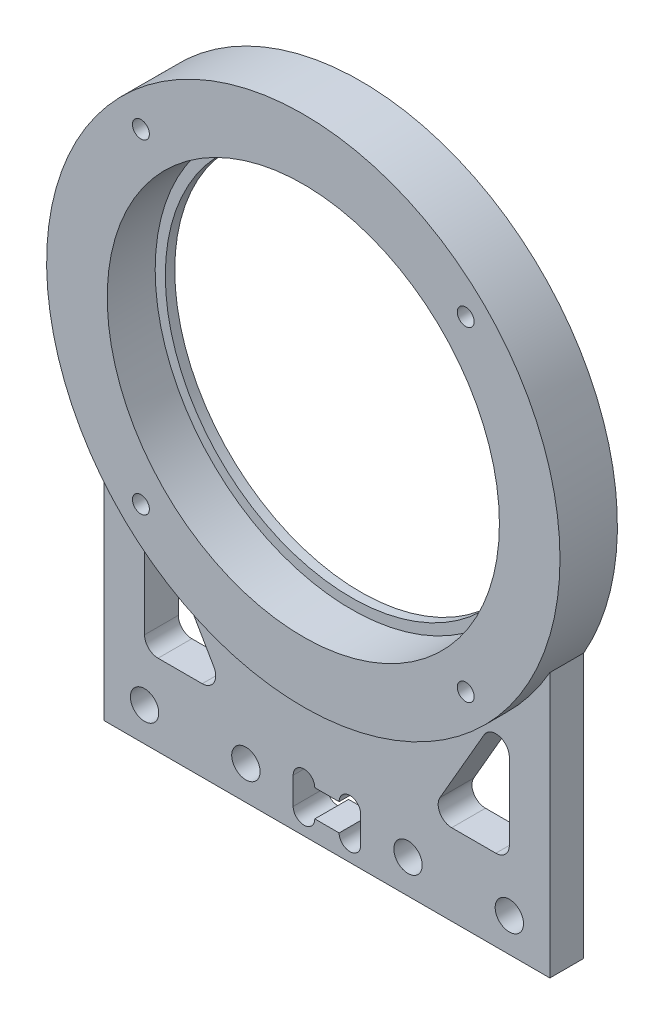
ISO-10303-21;
HEADER;
FILE_DESCRIPTION(('STEP AP214'),'2;1');
FILE_NAME('part.step','',(''),(''),'','','');
FILE_SCHEMA(('AUTOMOTIVE_DESIGN { 1 0 10303 214 1 1 1 1 }'));
ENDSEC;
DATA;
#1=APPLICATION_CONTEXT('core data for automotive mechanical design processes');
#2=APPLICATION_PROTOCOL_DEFINITION('international standard','automotive_design',2000,#1);
#3=PRODUCT_CONTEXT('',#1,'mechanical');
#4=PRODUCT('Part','Part','',(#3));
#5=PRODUCT_RELATED_PRODUCT_CATEGORY('part','',(#4));
#6=PRODUCT_DEFINITION_FORMATION('','',#4);
#7=PRODUCT_DEFINITION_CONTEXT('part definition',#1,'design');
#8=PRODUCT_DEFINITION('design','',#6,#7);
#9=PRODUCT_DEFINITION_SHAPE('','',#8);
#10=(LENGTH_UNIT() NAMED_UNIT(*) SI_UNIT(.MILLI.,.METRE.));
#11=(NAMED_UNIT(*) PLANE_ANGLE_UNIT() SI_UNIT($,.RADIAN.));
#12=(NAMED_UNIT(*) SI_UNIT($,.STERADIAN.) SOLID_ANGLE_UNIT());
#13=UNCERTAINTY_MEASURE_WITH_UNIT(LENGTH_MEASURE(1.E-05),#10,'distance_accuracy_value','');
#14=(GEOMETRIC_REPRESENTATION_CONTEXT(3) GLOBAL_UNCERTAINTY_ASSIGNED_CONTEXT((#13)) GLOBAL_UNIT_ASSIGNED_CONTEXT((#10,
#11,#12)) REPRESENTATION_CONTEXT('',''));
#15=CARTESIAN_POINT('',(0.,0.,0.));
#16=DIRECTION('',(0.,0.,1.));
#17=DIRECTION('',(1.,0.,0.));
#18=AXIS2_PLACEMENT_3D('',#15,#16,#17);
#19=CARTESIAN_POINT('',(0.,0.,1.4));
#20=DIRECTION('',(0.,0.,-1.));
#21=DIRECTION('',(0.,-1.,0.));
#22=AXIS2_PLACEMENT_3D('',#19,#20,#21);
#23=PLANE('',#22);
#24=CARTESIAN_POINT('',(0.,0.,1.4));
#25=DIRECTION('',(0.,0.,-1.));
#26=DIRECTION('',(-1.,0.,0.));
#27=AXIS2_PLACEMENT_3D('',#24,#25,#26);
#28=CIRCLE('',#27,27.53);
#29=CARTESIAN_POINT('',(-27.53,0.,1.4));
#30=VERTEX_POINT('',#29);
#31=EDGE_CURVE('E570',#30,#30,#28,.T.);
#32=ORIENTED_EDGE('',*,*,#31,.T.);
#33=EDGE_LOOP('',(#32));
#34=FACE_BOUND('',#33,.T.);
#35=CARTESIAN_POINT('',(0.,0.,1.4));
#36=DIRECTION('',(0.,0.,1.));
#37=DIRECTION('',(-1.,0.,0.));
#38=AXIS2_PLACEMENT_3D('',#35,#36,#37);
#39=CIRCLE('',#38,29.03);
#40=CARTESIAN_POINT('',(-29.03,0.,1.4));
#41=VERTEX_POINT('',#40);
#42=EDGE_CURVE('E160',#41,#41,#39,.T.);
#43=ORIENTED_EDGE('',*,*,#42,.T.);
#44=EDGE_LOOP('',(#43));
#45=FACE_BOUND('',#44,.T.);
#46=ADVANCED_FACE('F17',(#34,#45),#23,.F.);
#47=CARTESIAN_POINT('',(-25.,-44.,-21.5));
#48=DIRECTION('',(0.,0.,-1.));
#49=DIRECTION('',(-1.,0.,0.));
#50=AXIS2_PLACEMENT_3D('',#47,#48,#49);
#51=CYLINDRICAL_SURFACE('',#50,2.);
#52=CARTESIAN_POINT('',(-25.,-44.,0.));
#53=DIRECTION('',(0.,0.,1.));
#54=DIRECTION('',(1.,0.,0.));
#55=AXIS2_PLACEMENT_3D('',#52,#53,#54);
#56=CIRCLE('',#55,2.);
#57=CARTESIAN_POINT('',(-27.,-44.,0.));
#58=VERTEX_POINT('',#57);
#59=CARTESIAN_POINT('',(-25.,-46.,0.));
#60=VERTEX_POINT('',#59);
#61=EDGE_CURVE('E260',#58,#60,#56,.T.);
#62=ORIENTED_EDGE('',*,*,#61,.F.);
#63=DIRECTION('',(0.,0.,-1.));
#64=VECTOR('',#63,1.);
#65=CARTESIAN_POINT('',(-27.,-44.,0.));
#66=LINE('',#65,#64);
#67=CARTESIAN_POINT('',(-27.,-44.,5.));
#68=VERTEX_POINT('',#67);
#69=EDGE_CURVE('E11',#68,#58,#66,.T.);
#70=ORIENTED_EDGE('',*,*,#69,.F.);
#71=CARTESIAN_POINT('',(-25.,-44.,5.));
#72=DIRECTION('',(0.,0.,-1.));
#73=DIRECTION('',(1.,0.,0.));
#74=AXIS2_PLACEMENT_3D('',#71,#72,#73);
#75=CIRCLE('',#74,2.);
#76=CARTESIAN_POINT('',(-25.,-46.,5.));
#77=VERTEX_POINT('',#76);
#78=EDGE_CURVE('E323',#77,#68,#75,.T.);
#79=ORIENTED_EDGE('',*,*,#78,.F.);
#80=DIRECTION('',(0.,0.,1.));
#81=VECTOR('',#80,1.);
#82=CARTESIAN_POINT('',(-25.,-46.,5.));
#83=LINE('',#82,#81);
#84=EDGE_CURVE('E381',#60,#77,#83,.T.);
#85=ORIENTED_EDGE('',*,*,#84,.F.);
#86=EDGE_LOOP('',(#62,#70,#79,#85));
#87=FACE_BOUND('',#86,.T.);
#88=ADVANCED_FACE('F407',(#87),#51,.F.);
#89=CARTESIAN_POINT('',(-18.4641016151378,-44.,-21.5));
#90=DIRECTION('',(0.,0.,-1.));
#91=DIRECTION('',(-1.,0.,0.));
#92=AXIS2_PLACEMENT_3D('',#89,#90,#91);
#93=CYLINDRICAL_SURFACE('',#92,2.);
#94=CARTESIAN_POINT('',(-18.4641016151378,-44.,0.));
#95=DIRECTION('',(0.,0.,1.));
#96=DIRECTION('',(1.,0.,0.));
#97=AXIS2_PLACEMENT_3D('',#94,#95,#96);
#98=CIRCLE('',#97,2.);
#99=CARTESIAN_POINT('',(-18.4641016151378,-46.,0.));
#100=VERTEX_POINT('',#99);
#101=CARTESIAN_POINT('',(-16.7320508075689,-43.,0.));
#102=VERTEX_POINT('',#101);
#103=EDGE_CURVE('E272',#100,#102,#98,.T.);
#104=ORIENTED_EDGE('',*,*,#103,.F.);
#105=DIRECTION('',(0.,0.,-1.));
#106=VECTOR('',#105,1.);
#107=CARTESIAN_POINT('',(-18.4641016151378,-46.,0.));
#108=LINE('',#107,#106);
#109=CARTESIAN_POINT('',(-18.4641016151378,-46.,5.));
#110=VERTEX_POINT('',#109);
#111=EDGE_CURVE('E377',#110,#100,#108,.T.);
#112=ORIENTED_EDGE('',*,*,#111,.F.);
#113=CARTESIAN_POINT('',(-18.4641016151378,-44.,5.));
#114=DIRECTION('',(0.,0.,-1.));
#115=DIRECTION('',(1.,0.,0.));
#116=AXIS2_PLACEMENT_3D('',#113,#114,#115);
#117=CIRCLE('',#116,2.);
#118=CARTESIAN_POINT('',(-16.7320508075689,-43.,5.));
#119=VERTEX_POINT('',#118);
#120=EDGE_CURVE('E311',#119,#110,#117,.T.);
#121=ORIENTED_EDGE('',*,*,#120,.F.);
#122=DIRECTION('',(0.,0.,1.));
#123=VECTOR('',#122,1.);
#124=CARTESIAN_POINT('',(-16.7320508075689,-43.,5.));
#125=LINE('',#124,#123);
#126=EDGE_CURVE('E374',#102,#119,#125,.T.);
#127=ORIENTED_EDGE('',*,*,#126,.F.);
#128=EDGE_LOOP('',(#104,#112,#121,#127));
#129=FACE_BOUND('',#128,.T.);
#130=ADVANCED_FACE('F1425',(#129),#93,.F.);
#131=CARTESIAN_POINT('',(-25.,-32.6794919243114,-21.5));
#132=DIRECTION('',(0.,0.,-1.));
#133=DIRECTION('',(-1.,0.,0.));
#134=AXIS2_PLACEMENT_3D('',#131,#132,#133);
#135=CYLINDRICAL_SURFACE('',#134,2.);
#136=CARTESIAN_POINT('',(-25.,-32.6794919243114,0.));
#137=DIRECTION('',(0.,0.,1.));
#138=DIRECTION('',(1.,0.,0.));
#139=AXIS2_PLACEMENT_3D('',#136,#137,#138);
#140=CIRCLE('',#139,2.);
#141=CARTESIAN_POINT('',(-23.2679491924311,-31.6794919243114,0.));
#142=VERTEX_POINT('',#141);
#143=CARTESIAN_POINT('',(-27.,-32.6794919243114,0.));
#144=VERTEX_POINT('',#143);
#145=EDGE_CURVE('E280',#142,#144,#140,.T.);
#146=ORIENTED_EDGE('',*,*,#145,.F.);
#147=DIRECTION('',(0.,0.,-1.));
#148=VECTOR('',#147,1.);
#149=CARTESIAN_POINT('',(-23.2679491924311,-31.6794919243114,0.));
#150=LINE('',#149,#148);
#151=CARTESIAN_POINT('',(-23.2679491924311,-31.6794919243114,5.));
#152=VERTEX_POINT('',#151);
#153=EDGE_CURVE('E373',#152,#142,#150,.T.);
#154=ORIENTED_EDGE('',*,*,#153,.F.);
#155=CARTESIAN_POINT('',(-25.,-32.6794919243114,5.));
#156=DIRECTION('',(0.,0.,-1.));
#157=DIRECTION('',(1.,0.,0.));
#158=AXIS2_PLACEMENT_3D('',#155,#156,#157);
#159=CIRCLE('',#158,2.);
#160=CARTESIAN_POINT('',(-27.,-32.6794919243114,5.));
#161=VERTEX_POINT('',#160);
#162=EDGE_CURVE('E211',#161,#152,#159,.T.);
#163=ORIENTED_EDGE('',*,*,#162,.F.);
#164=DIRECTION('',(0.,0.,1.));
#165=VECTOR('',#164,1.);
#166=CARTESIAN_POINT('',(-27.,-32.6794919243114,8.5));
#167=LINE('',#166,#165);
#168=EDGE_CURVE('E26',#144,#161,#167,.T.);
#169=ORIENTED_EDGE('',*,*,#168,.F.);
#170=EDGE_LOOP('',(#146,#154,#163,#169));
#171=FACE_BOUND('',#170,.T.);
#172=ADVANCED_FACE('F397',(#171),#135,.F.);
#173=CARTESIAN_POINT('',(25.,-44.,-21.5));
#174=DIRECTION('',(0.,0.,-1.));
#175=DIRECTION('',(-1.,0.,0.));
#176=AXIS2_PLACEMENT_3D('',#173,#174,#175);
#177=CYLINDRICAL_SURFACE('',#176,2.);
#178=CARTESIAN_POINT('',(25.,-44.,0.));
#179=DIRECTION('',(0.,0.,1.));
#180=DIRECTION('',(1.,0.,0.));
#181=AXIS2_PLACEMENT_3D('',#178,#179,#180);
#182=CIRCLE('',#181,2.);
#183=CARTESIAN_POINT('',(25.,-46.,0.));
#184=VERTEX_POINT('',#183);
#185=CARTESIAN_POINT('',(27.,-44.,0.));
#186=VERTEX_POINT('',#185);
#187=EDGE_CURVE('E234',#184,#186,#182,.T.);
#188=ORIENTED_EDGE('',*,*,#187,.F.);
#189=DIRECTION('',(0.,0.,-1.));
#190=VECTOR('',#189,1.);
#191=CARTESIAN_POINT('',(25.,-46.,0.));
#192=LINE('',#191,#190);
#193=CARTESIAN_POINT('',(25.,-46.,5.));
#194=VERTEX_POINT('',#193);
#195=EDGE_CURVE('E359',#194,#184,#192,.T.);
#196=ORIENTED_EDGE('',*,*,#195,.F.);
#197=CARTESIAN_POINT('',(25.,-44.,5.));
#198=DIRECTION('',(0.,0.,-1.));
#199=DIRECTION('',(1.,0.,0.));
#200=AXIS2_PLACEMENT_3D('',#197,#198,#199);
#201=CIRCLE('',#200,2.);
#202=CARTESIAN_POINT('',(27.,-44.,5.));
#203=VERTEX_POINT('',#202);
#204=EDGE_CURVE('E149',#203,#194,#201,.T.);
#205=ORIENTED_EDGE('',*,*,#204,.F.);
#206=DIRECTION('',(0.,0.,1.));
#207=VECTOR('',#206,1.);
#208=CARTESIAN_POINT('',(27.,-44.,5.));
#209=LINE('',#208,#207);
#210=EDGE_CURVE('E370',#186,#203,#209,.T.);
#211=ORIENTED_EDGE('',*,*,#210,.F.);
#212=EDGE_LOOP('',(#188,#196,#205,#211));
#213=FACE_BOUND('',#212,.T.);
#214=ADVANCED_FACE('F1404',(#213),#177,.F.);
#215=CARTESIAN_POINT('',(25.,-32.6794919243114,-21.5));
#216=DIRECTION('',(0.,0.,-1.));
#217=DIRECTION('',(-1.,0.,0.));
#218=AXIS2_PLACEMENT_3D('',#215,#216,#217);
#219=CYLINDRICAL_SURFACE('',#218,2.);
#220=CARTESIAN_POINT('',(25.,-32.6794919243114,0.));
#221=DIRECTION('',(0.,0.,1.));
#222=DIRECTION('',(1.,0.,0.));
#223=AXIS2_PLACEMENT_3D('',#220,#221,#222);
#224=CIRCLE('',#223,2.);
#225=CARTESIAN_POINT('',(27.,-32.6794919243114,0.));
#226=VERTEX_POINT('',#225);
#227=CARTESIAN_POINT('',(23.2679491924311,-31.6794919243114,0.));
#228=VERTEX_POINT('',#227);
#229=EDGE_CURVE('E292',#226,#228,#224,.T.);
#230=ORIENTED_EDGE('',*,*,#229,.F.);
#231=DIRECTION('',(0.,0.,-1.));
#232=VECTOR('',#231,1.);
#233=CARTESIAN_POINT('',(27.,-32.6794919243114,0.));
#234=LINE('',#233,#232);
#235=CARTESIAN_POINT('',(27.,-32.6794919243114,5.));
#236=VERTEX_POINT('',#235);
#237=EDGE_CURVE('E366',#236,#226,#234,.T.);
#238=ORIENTED_EDGE('',*,*,#237,.F.);
#239=CARTESIAN_POINT('',(25.,-32.6794919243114,5.));
#240=DIRECTION('',(0.,0.,-1.));
#241=DIRECTION('',(1.,0.,0.));
#242=AXIS2_PLACEMENT_3D('',#239,#240,#241);
#243=CIRCLE('',#242,2.);
#244=CARTESIAN_POINT('',(23.2679491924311,-31.6794919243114,5.));
#245=VERTEX_POINT('',#244);
#246=EDGE_CURVE('E183',#245,#236,#243,.T.);
#247=ORIENTED_EDGE('',*,*,#246,.F.);
#248=DIRECTION('',(0.,0.,1.));
#249=VECTOR('',#248,1.);
#250=CARTESIAN_POINT('',(23.2679491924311,-31.6794919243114,8.5));
#251=LINE('',#250,#249);
#252=EDGE_CURVE('E363',#228,#245,#251,.T.);
#253=ORIENTED_EDGE('',*,*,#252,.F.);
#254=EDGE_LOOP('',(#230,#238,#247,#253));
#255=FACE_BOUND('',#254,.T.);
#256=ADVANCED_FACE('F1394',(#255),#219,.F.);
#257=CARTESIAN_POINT('',(-27.,-25.2153903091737,-21.5));
#258=DIRECTION('',(-1.,0.,0.));
#259=DIRECTION('',(0.,0.,1.));
#260=AXIS2_PLACEMENT_3D('',#257,#258,#259);
#261=PLANE('',#260);
#262=DIRECTION('',(0.,-1.,0.));
#263=VECTOR('',#262,1.);
#264=CARTESIAN_POINT('',(-27.,0.,0.));
#265=LINE('',#264,#263);
#266=EDGE_CURVE('E256',#144,#58,#265,.T.);
#267=ORIENTED_EDGE('',*,*,#266,.F.);
#268=ORIENTED_EDGE('',*,*,#168,.T.);
#269=DIRECTION('',(0.,-1.,0.));
#270=VECTOR('',#269,1.);
#271=CARTESIAN_POINT('',(-27.,0.,5.));
#272=LINE('',#271,#270);
#273=EDGE_CURVE('E216',#161,#68,#272,.T.);
#274=ORIENTED_EDGE('',*,*,#273,.T.);
#275=ORIENTED_EDGE('',*,*,#69,.T.);
#276=EDGE_LOOP('',(#267,#268,#274,#275));
#277=FACE_BOUND('',#276,.T.);
#278=ADVANCED_FACE('F391',(#277),#261,.F.);
#279=CARTESIAN_POINT('',(-27.,-46.,-21.5));
#280=DIRECTION('',(0.,-1.,0.));
#281=DIRECTION('',(0.,0.,-1.));
#282=AXIS2_PLACEMENT_3D('',#279,#280,#281);
#283=PLANE('',#282);
#284=DIRECTION('',(1.,0.,0.));
#285=VECTOR('',#284,1.);
#286=CARTESIAN_POINT('',(0.,-46.,5.));
#287=LINE('',#286,#285);
#288=EDGE_CURVE('E319',#77,#110,#287,.T.);
#289=ORIENTED_EDGE('',*,*,#288,.T.);
#290=ORIENTED_EDGE('',*,*,#111,.T.);
#291=DIRECTION('',(1.,0.,0.));
#292=VECTOR('',#291,1.);
#293=CARTESIAN_POINT('',(0.,-46.,0.));
#294=LINE('',#293,#292);
#295=EDGE_CURVE('E268',#60,#100,#294,.T.);
#296=ORIENTED_EDGE('',*,*,#295,.F.);
#297=ORIENTED_EDGE('',*,*,#84,.T.);
#298=EDGE_LOOP('',(#289,#290,#296,#297));
#299=FACE_BOUND('',#298,.T.);
#300=ADVANCED_FACE('F1374',(#299),#283,.F.);
#301=CARTESIAN_POINT('',(-15.,-46.,-21.5));
#302=DIRECTION('',(0.866025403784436,0.5,0.));
#303=DIRECTION('',(0.,0.,-1.));
#304=AXIS2_PLACEMENT_3D('',#301,#302,#303);
#305=PLANE('',#304);
#306=DIRECTION('',(-0.5,0.866025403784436,0.));
#307=VECTOR('',#306,1.);
#308=CARTESIAN_POINT('',(-31.1685842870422,-17.9951905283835,5.));
#309=LINE('',#308,#307);
#310=EDGE_CURVE('E215',#119,#152,#309,.T.);
#311=ORIENTED_EDGE('',*,*,#310,.T.);
#312=ORIENTED_EDGE('',*,*,#153,.T.);
#313=DIRECTION('',(-0.5,0.866025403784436,0.));
#314=VECTOR('',#313,1.);
#315=CARTESIAN_POINT('',(-31.1685842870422,-17.9951905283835,0.));
#316=LINE('',#315,#314);
#317=EDGE_CURVE('E276',#102,#142,#316,.T.);
#318=ORIENTED_EDGE('',*,*,#317,.F.);
#319=ORIENTED_EDGE('',*,*,#126,.T.);
#320=EDGE_LOOP('',(#311,#312,#318,#319));
#321=FACE_BOUND('',#320,.T.);
#322=ADVANCED_FACE('F1216',(#321),#305,.F.);
#323=CARTESIAN_POINT('',(27.,-25.2153903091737,-21.5));
#324=DIRECTION('',(1.,0.,0.));
#325=DIRECTION('',(0.,1.,0.));
#326=AXIS2_PLACEMENT_3D('',#323,#324,#325);
#327=PLANE('',#326);
#328=DIRECTION('',(0.,1.,0.));
#329=VECTOR('',#328,1.);
#330=CARTESIAN_POINT('',(27.,0.,5.));
#331=LINE('',#330,#329);
#332=EDGE_CURVE('E179',#203,#236,#331,.T.);
#333=ORIENTED_EDGE('',*,*,#332,.T.);
#334=ORIENTED_EDGE('',*,*,#237,.T.);
#335=DIRECTION('',(0.,1.,0.));
#336=VECTOR('',#335,1.);
#337=CARTESIAN_POINT('',(27.,0.,0.));
#338=LINE('',#337,#336);
#339=EDGE_CURVE('E288',#186,#226,#338,.T.);
#340=ORIENTED_EDGE('',*,*,#339,.F.);
#341=ORIENTED_EDGE('',*,*,#210,.T.);
#342=EDGE_LOOP('',(#333,#334,#340,#341));
#343=FACE_BOUND('',#342,.T.);
#344=ADVANCED_FACE('F1212',(#343),#327,.F.);
#345=CARTESIAN_POINT('',(15.,-46.,-21.5));
#346=DIRECTION('',(-0.866025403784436,0.5,0.));
#347=DIRECTION('',(0.,0.,1.));
#348=AXIS2_PLACEMENT_3D('',#345,#346,#347);
#349=PLANE('',#348);
#350=DIRECTION('',(-0.5,-0.866025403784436,0.));
#351=VECTOR('',#350,1.);
#352=CARTESIAN_POINT('',(31.1685842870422,-17.9951905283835,5.));
#353=LINE('',#352,#351);
#354=CARTESIAN_POINT('',(16.7320508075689,-43.,5.));
#355=VERTEX_POINT('',#354);
#356=EDGE_CURVE('E331',#245,#355,#353,.T.);
#357=ORIENTED_EDGE('',*,*,#356,.T.);
#358=DIRECTION('',(0.,0.,-1.));
#359=VECTOR('',#358,1.);
#360=CARTESIAN_POINT('',(16.7320508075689,-43.,0.));
#361=LINE('',#360,#359);
#362=CARTESIAN_POINT('',(16.7320508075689,-43.,0.));
#363=VERTEX_POINT('',#362);
#364=EDGE_CURVE('E153',#355,#363,#361,.T.);
#365=ORIENTED_EDGE('',*,*,#364,.T.);
#366=DIRECTION('',(-0.5,-0.866025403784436,0.));
#367=VECTOR('',#366,1.);
#368=CARTESIAN_POINT('',(31.1685842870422,-17.9951905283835,0.));
#369=LINE('',#368,#367);
#370=EDGE_CURVE('E611',#228,#363,#369,.T.);
#371=ORIENTED_EDGE('',*,*,#370,.F.);
#372=ORIENTED_EDGE('',*,*,#252,.T.);
#373=EDGE_LOOP('',(#357,#365,#371,#372));
#374=FACE_BOUND('',#373,.T.);
#375=ADVANCED_FACE('F610',(#374),#349,.F.);
#376=CARTESIAN_POINT('',(27.,-46.,-21.5));
#377=DIRECTION('',(0.,-1.,0.));
#378=DIRECTION('',(0.,0.,-1.));
#379=AXIS2_PLACEMENT_3D('',#376,#377,#378);
#380=PLANE('',#379);
#381=DIRECTION('',(1.,0.,0.));
#382=VECTOR('',#381,1.);
#383=CARTESIAN_POINT('',(0.,-46.,0.));
#384=LINE('',#383,#382);
#385=CARTESIAN_POINT('',(18.4641016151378,-46.,0.));
#386=VERTEX_POINT('',#385);
#387=EDGE_CURVE('E239',#386,#184,#384,.T.);
#388=ORIENTED_EDGE('',*,*,#387,.F.);
#389=DIRECTION('',(0.,0.,1.));
#390=VECTOR('',#389,1.);
#391=CARTESIAN_POINT('',(18.4641016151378,-46.,5.));
#392=LINE('',#391,#390);
#393=CARTESIAN_POINT('',(18.4641016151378,-46.,5.));
#394=VERTEX_POINT('',#393);
#395=EDGE_CURVE('E355',#386,#394,#392,.T.);
#396=ORIENTED_EDGE('',*,*,#395,.T.);
#397=DIRECTION('',(1.,0.,0.));
#398=VECTOR('',#397,1.);
#399=CARTESIAN_POINT('',(0.,-46.,5.));
#400=LINE('',#399,#398);
#401=EDGE_CURVE('E139',#394,#194,#400,.T.);
#402=ORIENTED_EDGE('',*,*,#401,.T.);
#403=ORIENTED_EDGE('',*,*,#195,.T.);
#404=EDGE_LOOP('',(#388,#396,#402,#403));
#405=FACE_BOUND('',#404,.T.);
#406=ADVANCED_FACE('F622',(#405),#380,.F.);
#407=CARTESIAN_POINT('',(3.4,-55.,-33.5));
#408=DIRECTION('',(0.,0.,1.));
#409=DIRECTION('',(1.,0.,0.));
#410=AXIS2_PLACEMENT_3D('',#407,#408,#409);
#411=CYLINDRICAL_SURFACE('',#410,1.6);
#412=CARTESIAN_POINT('',(3.4,-55.,0.));
#413=DIRECTION('',(0.,0.,1.));
#414=DIRECTION('',(1.,0.,0.));
#415=AXIS2_PLACEMENT_3D('',#412,#413,#414);
#416=CIRCLE('',#415,1.6);
#417=CARTESIAN_POINT('',(1.8,-55.,0.));
#418=VERTEX_POINT('',#417);
#419=CARTESIAN_POINT('',(5.,-55.,0.));
#420=VERTEX_POINT('',#419);
#421=EDGE_CURVE('E202',#418,#420,#416,.T.);
#422=ORIENTED_EDGE('',*,*,#421,.F.);
#423=DIRECTION('',(0.,0.,-1.));
#424=VECTOR('',#423,1.);
#425=CARTESIAN_POINT('',(1.8,-55.,-33.5));
#426=LINE('',#425,#424);
#427=CARTESIAN_POINT('',(1.8,-55.,5.));
#428=VERTEX_POINT('',#427);
#429=EDGE_CURVE('E40',#428,#418,#426,.T.);
#430=ORIENTED_EDGE('',*,*,#429,.F.);
#431=CARTESIAN_POINT('',(3.4,-55.,5.));
#432=DIRECTION('',(0.,0.,1.));
#433=DIRECTION('',(1.,0.,0.));
#434=AXIS2_PLACEMENT_3D('',#431,#432,#433);
#435=CIRCLE('',#434,1.6);
#436=CARTESIAN_POINT('',(5.,-55.,5.));
#437=VERTEX_POINT('',#436);
#438=EDGE_CURVE('E129',#428,#437,#435,.T.);
#439=ORIENTED_EDGE('',*,*,#438,.T.);
#440=DIRECTION('',(0.,0.,1.));
#441=VECTOR('',#440,1.);
#442=CARTESIAN_POINT('',(5.,-55.,-33.5));
#443=LINE('',#442,#441);
#444=EDGE_CURVE('E131',#420,#437,#443,.T.);
#445=ORIENTED_EDGE('',*,*,#444,.F.);
#446=EDGE_LOOP('',(#422,#430,#439,#445));
#447=FACE_BOUND('',#446,.T.);
#448=ADVANCED_FACE('F1281',(#447),#411,.F.);
#449=CARTESIAN_POINT('',(-3.4,-55.,-33.5));
#450=DIRECTION('',(0.,0.,1.));
#451=DIRECTION('',(1.,0.,0.));
#452=AXIS2_PLACEMENT_3D('',#449,#450,#451);
#453=CYLINDRICAL_SURFACE('',#452,1.6);
#454=CARTESIAN_POINT('',(-3.4,-55.,0.));
#455=DIRECTION('',(0.,0.,1.));
#456=DIRECTION('',(1.,0.,0.));
#457=AXIS2_PLACEMENT_3D('',#454,#455,#456);
#458=CIRCLE('',#457,1.6);
#459=CARTESIAN_POINT('',(-5.,-55.,0.));
#460=VERTEX_POINT('',#459);
#461=CARTESIAN_POINT('',(-1.8,-55.,0.));
#462=VERTEX_POINT('',#461);
#463=EDGE_CURVE('E296',#460,#462,#458,.T.);
#464=ORIENTED_EDGE('',*,*,#463,.F.);
#465=DIRECTION('',(0.,0.,1.));
#466=VECTOR('',#465,1.);
#467=CARTESIAN_POINT('',(-5.,-55.,-33.5));
#468=LINE('',#467,#466);
#469=CARTESIAN_POINT('',(-5.,-55.,5.));
#470=VERTEX_POINT('',#469);
#471=EDGE_CURVE('E135',#460,#470,#468,.T.);
#472=ORIENTED_EDGE('',*,*,#471,.T.);
#473=CARTESIAN_POINT('',(-3.4,-55.,5.));
#474=DIRECTION('',(0.,0.,1.));
#475=DIRECTION('',(1.,0.,0.));
#476=AXIS2_PLACEMENT_3D('',#473,#474,#475);
#477=CIRCLE('',#476,1.6);
#478=CARTESIAN_POINT('',(-1.8,-55.,5.));
#479=VERTEX_POINT('',#478);
#480=EDGE_CURVE('E127',#470,#479,#477,.T.);
#481=ORIENTED_EDGE('',*,*,#480,.T.);
#482=DIRECTION('',(0.,0.,1.));
#483=VECTOR('',#482,1.);
#484=CARTESIAN_POINT('',(-1.8,-55.,-33.5));
#485=LINE('',#484,#483);
#486=EDGE_CURVE('E107',#462,#479,#485,.T.);
#487=ORIENTED_EDGE('',*,*,#486,.F.);
#488=EDGE_LOOP('',(#464,#472,#481,#487));
#489=FACE_BOUND('',#488,.T.);
#490=ADVANCED_FACE('F133',(#489),#453,.F.);
#491=CARTESIAN_POINT('',(3.4,-51.,-33.5));
#492=DIRECTION('',(0.,0.,1.));
#493=DIRECTION('',(1.,0.,0.));
#494=AXIS2_PLACEMENT_3D('',#491,#492,#493);
#495=CYLINDRICAL_SURFACE('',#494,1.6);
#496=CARTESIAN_POINT('',(3.4,-51.,0.));
#497=DIRECTION('',(0.,0.,1.));
#498=DIRECTION('',(1.,0.,0.));
#499=AXIS2_PLACEMENT_3D('',#496,#497,#498);
#500=CIRCLE('',#499,1.6);
#501=CARTESIAN_POINT('',(5.,-51.,0.));
#502=VERTEX_POINT('',#501);
#503=CARTESIAN_POINT('',(1.8,-51.,0.));
#504=VERTEX_POINT('',#503);
#505=EDGE_CURVE('E243',#502,#504,#500,.T.);
#506=ORIENTED_EDGE('',*,*,#505,.F.);
#507=DIRECTION('',(0.,0.,1.));
#508=VECTOR('',#507,1.);
#509=CARTESIAN_POINT('',(5.,-51.,-33.5));
#510=LINE('',#509,#508);
#511=CARTESIAN_POINT('',(5.,-51.,5.));
#512=VERTEX_POINT('',#511);
#513=EDGE_CURVE('E120',#502,#512,#510,.T.);
#514=ORIENTED_EDGE('',*,*,#513,.T.);
#515=CARTESIAN_POINT('',(3.4,-51.,5.));
#516=DIRECTION('',(0.,0.,1.));
#517=DIRECTION('',(1.,0.,0.));
#518=AXIS2_PLACEMENT_3D('',#515,#516,#517);
#519=CIRCLE('',#518,1.6);
#520=CARTESIAN_POINT('',(1.8,-51.,5.));
#521=VERTEX_POINT('',#520);
#522=EDGE_CURVE('E343',#512,#521,#519,.T.);
#523=ORIENTED_EDGE('',*,*,#522,.T.);
#524=DIRECTION('',(0.,0.,1.));
#525=VECTOR('',#524,1.);
#526=CARTESIAN_POINT('',(1.8,-51.,-33.5));
#527=LINE('',#526,#525);
#528=EDGE_CURVE('E263',#504,#521,#527,.T.);
#529=ORIENTED_EDGE('',*,*,#528,.F.);
#530=EDGE_LOOP('',(#506,#514,#523,#529));
#531=FACE_BOUND('',#530,.T.);
#532=ADVANCED_FACE('F662',(#531),#495,.F.);
#533=CARTESIAN_POINT('',(-3.4,-51.,-33.5));
#534=DIRECTION('',(0.,0.,1.));
#535=DIRECTION('',(1.,0.,0.));
#536=AXIS2_PLACEMENT_3D('',#533,#534,#535);
#537=CYLINDRICAL_SURFACE('',#536,1.6);
#538=CARTESIAN_POINT('',(-3.4,-51.,0.));
#539=DIRECTION('',(0.,0.,1.));
#540=DIRECTION('',(1.,0.,0.));
#541=AXIS2_PLACEMENT_3D('',#538,#539,#540);
#542=CIRCLE('',#541,1.6);
#543=CARTESIAN_POINT('',(-1.8,-51.,0.));
#544=VERTEX_POINT('',#543);
#545=CARTESIAN_POINT('',(-5.,-51.,0.));
#546=VERTEX_POINT('',#545);
#547=EDGE_CURVE('E196',#544,#546,#542,.T.);
#548=ORIENTED_EDGE('',*,*,#547,.F.);
#549=DIRECTION('',(0.,0.,-1.));
#550=VECTOR('',#549,1.);
#551=CARTESIAN_POINT('',(-1.8,-51.,-33.5));
#552=LINE('',#551,#550);
#553=CARTESIAN_POINT('',(-1.8,-51.,5.));
#554=VERTEX_POINT('',#553);
#555=EDGE_CURVE('E315',#554,#544,#552,.T.);
#556=ORIENTED_EDGE('',*,*,#555,.F.);
#557=CARTESIAN_POINT('',(-3.4,-51.,5.));
#558=DIRECTION('',(0.,0.,1.));
#559=DIRECTION('',(1.,0.,0.));
#560=AXIS2_PLACEMENT_3D('',#557,#558,#559);
#561=CIRCLE('',#560,1.6);
#562=CARTESIAN_POINT('',(-5.,-51.,5.));
#563=VERTEX_POINT('',#562);
#564=EDGE_CURVE('E146',#554,#563,#561,.T.);
#565=ORIENTED_EDGE('',*,*,#564,.T.);
#566=DIRECTION('',(0.,0.,1.));
#567=VECTOR('',#566,1.);
#568=CARTESIAN_POINT('',(-5.,-51.,-33.5));
#569=LINE('',#568,#567);
#570=EDGE_CURVE('E264',#546,#563,#569,.T.);
#571=ORIENTED_EDGE('',*,*,#570,.F.);
#572=EDGE_LOOP('',(#548,#556,#565,#571));
#573=FACE_BOUND('',#572,.T.);
#574=ADVANCED_FACE('F656',(#573),#537,.F.);
#575=CARTESIAN_POINT('',(-5.,-51.,-33.5));
#576=DIRECTION('',(0.,1.,0.));
#577=DIRECTION('',(1.,0.,0.));
#578=AXIS2_PLACEMENT_3D('',#575,#576,#577);
#579=PLANE('',#578);
#580=DIRECTION('',(-1.,0.,0.));
#581=VECTOR('',#580,1.);
#582=CARTESIAN_POINT('',(0.,-51.,0.));
#583=LINE('',#582,#581);
#584=EDGE_CURVE('E201',#504,#544,#583,.T.);
#585=ORIENTED_EDGE('',*,*,#584,.F.);
#586=ORIENTED_EDGE('',*,*,#528,.T.);
#587=DIRECTION('',(-1.,0.,0.));
#588=VECTOR('',#587,1.);
#589=CARTESIAN_POINT('',(0.,-51.,5.));
#590=LINE('',#589,#588);
#591=EDGE_CURVE('E327',#521,#554,#590,.T.);
#592=ORIENTED_EDGE('',*,*,#591,.T.);
#593=ORIENTED_EDGE('',*,*,#555,.T.);
#594=EDGE_LOOP('',(#585,#586,#592,#593));
#595=FACE_BOUND('',#594,.T.);
#596=ADVANCED_FACE('F659',(#595),#579,.F.);
#597=CARTESIAN_POINT('',(-5.,-51.,-33.5));
#598=DIRECTION('',(-1.,0.,0.));
#599=DIRECTION('',(0.,0.,1.));
#600=AXIS2_PLACEMENT_3D('',#597,#598,#599);
#601=PLANE('',#600);
#602=ORIENTED_EDGE('',*,*,#570,.T.);
#603=DIRECTION('',(0.,-1.,0.));
#604=VECTOR('',#603,1.);
#605=CARTESIAN_POINT('',(-5.,0.,5.));
#606=LINE('',#605,#604);
#607=EDGE_CURVE('E138',#563,#470,#606,.T.);
#608=ORIENTED_EDGE('',*,*,#607,.T.);
#609=ORIENTED_EDGE('',*,*,#471,.F.);
#610=DIRECTION('',(0.,-1.,0.));
#611=VECTOR('',#610,1.);
#612=CARTESIAN_POINT('',(-5.,0.,0.));
#613=LINE('',#612,#611);
#614=EDGE_CURVE('E238',#546,#460,#613,.T.);
#615=ORIENTED_EDGE('',*,*,#614,.F.);
#616=EDGE_LOOP('',(#602,#608,#609,#615));
#617=FACE_BOUND('',#616,.T.);
#618=ADVANCED_FACE('F651',(#617),#601,.F.);
#619=CARTESIAN_POINT('',(-5.,-55.,-33.5));
#620=DIRECTION('',(0.,-1.,0.));
#621=DIRECTION('',(0.,0.,-1.));
#622=AXIS2_PLACEMENT_3D('',#619,#620,#621);
#623=PLANE('',#622);
#624=DIRECTION('',(1.,0.,0.));
#625=VECTOR('',#624,1.);
#626=CARTESIAN_POINT('',(0.,-55.,0.));
#627=LINE('',#626,#625);
#628=EDGE_CURVE('E114',#462,#418,#627,.T.);
#629=ORIENTED_EDGE('',*,*,#628,.F.);
#630=ORIENTED_EDGE('',*,*,#486,.T.);
#631=DIRECTION('',(1.,0.,0.));
#632=VECTOR('',#631,1.);
#633=CARTESIAN_POINT('',(0.,-55.,5.));
#634=LINE('',#633,#632);
#635=EDGE_CURVE('E110',#479,#428,#634,.T.);
#636=ORIENTED_EDGE('',*,*,#635,.T.);
#637=ORIENTED_EDGE('',*,*,#429,.T.);
#638=EDGE_LOOP('',(#629,#630,#636,#637));
#639=FACE_BOUND('',#638,.T.);
#640=ADVANCED_FACE('F109',(#639),#623,.F.);
#641=CARTESIAN_POINT('',(5.,-51.,-33.5));
#642=DIRECTION('',(1.,0.,0.));
#643=DIRECTION('',(0.,1.,0.));
#644=AXIS2_PLACEMENT_3D('',#641,#642,#643);
#645=PLANE('',#644);
#646=ORIENTED_EDGE('',*,*,#444,.T.);
#647=DIRECTION('',(0.,1.,0.));
#648=VECTOR('',#647,1.);
#649=CARTESIAN_POINT('',(5.,0.,5.));
#650=LINE('',#649,#648);
#651=EDGE_CURVE('E347',#437,#512,#650,.T.);
#652=ORIENTED_EDGE('',*,*,#651,.T.);
#653=ORIENTED_EDGE('',*,*,#513,.F.);
#654=DIRECTION('',(0.,1.,0.));
#655=VECTOR('',#654,1.);
#656=CARTESIAN_POINT('',(5.,0.,0.));
#657=LINE('',#656,#655);
#658=EDGE_CURVE('E206',#420,#502,#657,.T.);
#659=ORIENTED_EDGE('',*,*,#658,.F.);
#660=EDGE_LOOP('',(#646,#652,#653,#659));
#661=FACE_BOUND('',#660,.T.);
#662=ADVANCED_FACE('F1273',(#661),#645,.F.);
#663=CARTESIAN_POINT('',(0.,0.,5.));
#664=DIRECTION('',(0.,0.,1.));
#665=DIRECTION('',(1.,0.,0.));
#666=AXIS2_PLACEMENT_3D('',#663,#664,#665);
#667=PLANE('',#666);
#668=CARTESIAN_POINT('',(27.,-53.,5.));
#669=DIRECTION('',(0.,0.,1.));
#670=DIRECTION('',(1.,0.,0.));
#671=AXIS2_PLACEMENT_3D('',#668,#669,#670);
#672=CIRCLE('',#671,2.1);
#673=CARTESIAN_POINT('',(29.1,-53.,5.));
#674=VERTEX_POINT('',#673);
#675=EDGE_CURVE('E188',#674,#674,#672,.T.);
#676=ORIENTED_EDGE('',*,*,#675,.F.);
#677=EDGE_LOOP('',(#676));
#678=FACE_BOUND('',#677,.T.);
#679=CARTESIAN_POINT('',(12.,-53.,5.));
#680=DIRECTION('',(0.,0.,1.));
#681=DIRECTION('',(1.,0.,0.));
#682=AXIS2_PLACEMENT_3D('',#679,#680,#681);
#683=CIRCLE('',#682,2.1);
#684=CARTESIAN_POINT('',(14.1,-53.,5.));
#685=VERTEX_POINT('',#684);
#686=EDGE_CURVE('E178',#685,#685,#683,.T.);
#687=ORIENTED_EDGE('',*,*,#686,.F.);
#688=EDGE_LOOP('',(#687));
#689=FACE_BOUND('',#688,.T.);
#690=CARTESIAN_POINT('',(-12.,-53.,5.));
#691=DIRECTION('',(0.,0.,1.));
#692=DIRECTION('',(1.,0.,0.));
#693=AXIS2_PLACEMENT_3D('',#690,#691,#692);
#694=CIRCLE('',#693,2.1);
#695=CARTESIAN_POINT('',(-9.9,-53.,5.));
#696=VERTEX_POINT('',#695);
#697=EDGE_CURVE('E170',#696,#696,#694,.T.);
#698=ORIENTED_EDGE('',*,*,#697,.F.);
#699=EDGE_LOOP('',(#698));
#700=FACE_BOUND('',#699,.T.);
#701=CARTESIAN_POINT('',(-27.,-53.,5.));
#702=DIRECTION('',(0.,0.,1.));
#703=DIRECTION('',(1.,0.,0.));
#704=AXIS2_PLACEMENT_3D('',#701,#702,#703);
#705=CIRCLE('',#704,2.1);
#706=CARTESIAN_POINT('',(-24.9,-53.,5.));
#707=VERTEX_POINT('',#706);
#708=EDGE_CURVE('E159',#707,#707,#705,.T.);
#709=ORIENTED_EDGE('',*,*,#708,.F.);
#710=EDGE_LOOP('',(#709));
#711=FACE_BOUND('',#710,.T.);
#712=ORIENTED_EDGE('',*,*,#480,.F.);
#713=ORIENTED_EDGE('',*,*,#607,.F.);
#714=ORIENTED_EDGE('',*,*,#564,.F.);
#715=ORIENTED_EDGE('',*,*,#591,.F.);
#716=ORIENTED_EDGE('',*,*,#522,.F.);
#717=ORIENTED_EDGE('',*,*,#651,.F.);
#718=ORIENTED_EDGE('',*,*,#438,.F.);
#719=ORIENTED_EDGE('',*,*,#635,.F.);
#720=EDGE_LOOP('',(#712,#713,#714,#715,#716,#717,#718,#719));
#721=FACE_BOUND('',#720,.T.);
#722=ORIENTED_EDGE('',*,*,#356,.F.);
#723=ORIENTED_EDGE('',*,*,#246,.T.);
#724=ORIENTED_EDGE('',*,*,#332,.F.);
#725=ORIENTED_EDGE('',*,*,#204,.T.);
#726=ORIENTED_EDGE('',*,*,#401,.F.);
#727=CARTESIAN_POINT('',(18.4641016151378,-44.,5.));
#728=DIRECTION('',(0.,0.,-1.));
#729=DIRECTION('',(1.,0.,0.));
#730=AXIS2_PLACEMENT_3D('',#727,#728,#729);
#731=CIRCLE('',#730,2.);
#732=EDGE_CURVE('E583',#394,#355,#731,.T.);
#733=ORIENTED_EDGE('',*,*,#732,.T.);
#734=EDGE_LOOP('',(#722,#723,#724,#725,#726,#733));
#735=FACE_BOUND('',#734,.T.);
#736=ORIENTED_EDGE('',*,*,#273,.F.);
#737=ORIENTED_EDGE('',*,*,#162,.T.);
#738=ORIENTED_EDGE('',*,*,#310,.F.);
#739=ORIENTED_EDGE('',*,*,#120,.T.);
#740=ORIENTED_EDGE('',*,*,#288,.F.);
#741=ORIENTED_EDGE('',*,*,#78,.T.);
#742=EDGE_LOOP('',(#736,#737,#738,#739,#740,#741));
#743=FACE_BOUND('',#742,.T.);
#744=CARTESIAN_POINT('',(0.,0.,5.));
#745=DIRECTION('',(0.,0.,-1.));
#746=DIRECTION('',(1.,0.,0.));
#747=AXIS2_PLACEMENT_3D('',#744,#745,#746);
#748=CIRCLE('',#747,38.);
#749=CARTESIAN_POINT('',(33.,-18.8414436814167,5.));
#750=VERTEX_POINT('',#749);
#751=CARTESIAN_POINT('',(-33.,-18.8414436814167,5.));
#752=VERTEX_POINT('',#751);
#753=EDGE_CURVE('E229',#750,#752,#748,.T.);
#754=ORIENTED_EDGE('',*,*,#753,.T.);
#755=DIRECTION('',(0.,-1.,0.));
#756=VECTOR('',#755,1.);
#757=CARTESIAN_POINT('',(-33.,-58.,5.));
#758=LINE('',#757,#756);
#759=CARTESIAN_POINT('',(-33.,-58.,5.));
#760=VERTEX_POINT('',#759);
#761=EDGE_CURVE('E284',#752,#760,#758,.T.);
#762=ORIENTED_EDGE('',*,*,#761,.T.);
#763=DIRECTION('',(1.,0.,0.));
#764=VECTOR('',#763,1.);
#765=CARTESIAN_POINT('',(-33.,-58.,5.));
#766=LINE('',#765,#764);
#767=CARTESIAN_POINT('',(33.,-58.,5.));
#768=VERTEX_POINT('',#767);
#769=EDGE_CURVE('E225',#760,#768,#766,.T.);
#770=ORIENTED_EDGE('',*,*,#769,.T.);
#771=DIRECTION('',(0.,1.,0.));
#772=VECTOR('',#771,1.);
#773=CARTESIAN_POINT('',(33.,-58.,5.));
#774=LINE('',#773,#772);
#775=EDGE_CURVE('E200',#768,#750,#774,.T.);
#776=ORIENTED_EDGE('',*,*,#775,.T.);
#777=EDGE_LOOP('',(#754,#762,#770,#776));
#778=FACE_BOUND('',#777,.T.);
#779=ADVANCED_FACE('F124',(#678,#689,#700,#711,#721,#735,#743,#778),#667,.T.);
#780=CARTESIAN_POINT('',(-33.,-58.,5.));
#781=DIRECTION('',(0.,1.,0.));
#782=DIRECTION('',(1.,0.,0.));
#783=AXIS2_PLACEMENT_3D('',#780,#781,#782);
#784=PLANE('',#783);
#785=DIRECTION('',(1.,0.,0.));
#786=VECTOR('',#785,1.);
#787=CARTESIAN_POINT('',(-33.,-58.,0.));
#788=LINE('',#787,#786);
#789=CARTESIAN_POINT('',(-33.,-58.,0.));
#790=VERTEX_POINT('',#789);
#791=CARTESIAN_POINT('',(33.,-58.,0.));
#792=VERTEX_POINT('',#791);
#793=EDGE_CURVE('E248',#790,#792,#788,.T.);
#794=ORIENTED_EDGE('',*,*,#793,.T.);
#795=DIRECTION('',(0.,0.,-1.));
#796=VECTOR('',#795,1.);
#797=CARTESIAN_POINT('',(33.,-58.,5.));
#798=LINE('',#797,#796);
#799=EDGE_CURVE('E217',#768,#792,#798,.T.);
#800=ORIENTED_EDGE('',*,*,#799,.F.);
#801=ORIENTED_EDGE('',*,*,#769,.F.);
#802=DIRECTION('',(0.,0.,-1.));
#803=VECTOR('',#802,1.);
#804=CARTESIAN_POINT('',(-33.,-58.,5.));
#805=LINE('',#804,#803);
#806=EDGE_CURVE('E221',#760,#790,#805,.T.);
#807=ORIENTED_EDGE('',*,*,#806,.T.);
#808=EDGE_LOOP('',(#794,#800,#801,#807));
#809=FACE_BOUND('',#808,.T.);
#810=ADVANCED_FACE('F516',(#809),#784,.F.);
#811=CARTESIAN_POINT('',(-33.,-58.,5.));
#812=DIRECTION('',(1.,0.,0.));
#813=DIRECTION('',(0.,1.,0.));
#814=AXIS2_PLACEMENT_3D('',#811,#812,#813);
#815=PLANE('',#814);
#816=DIRECTION('',(0.,-1.,0.));
#817=VECTOR('',#816,1.);
#818=CARTESIAN_POINT('',(-33.,-58.,0.));
#819=LINE('',#818,#817);
#820=CARTESIAN_POINT('',(-33.,-18.8414436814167,0.));
#821=VERTEX_POINT('',#820);
#822=EDGE_CURVE('E252',#821,#790,#819,.T.);
#823=ORIENTED_EDGE('',*,*,#822,.T.);
#824=ORIENTED_EDGE('',*,*,#806,.F.);
#825=ORIENTED_EDGE('',*,*,#761,.F.);
#826=DIRECTION('',(0.,0.,-1.));
#827=VECTOR('',#826,1.);
#828=CARTESIAN_POINT('',(-33.,-18.8414436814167,5.));
#829=LINE('',#828,#827);
#830=EDGE_CURVE('E209',#752,#821,#829,.T.);
#831=ORIENTED_EDGE('',*,*,#830,.T.);
#832=EDGE_LOOP('',(#823,#824,#825,#831));
#833=FACE_BOUND('',#832,.T.);
#834=ADVANCED_FACE('F523',(#833),#815,.F.);
#835=CARTESIAN_POINT('',(33.,-58.,5.));
#836=DIRECTION('',(-1.,0.,0.));
#837=DIRECTION('',(0.,0.,1.));
#838=AXIS2_PLACEMENT_3D('',#835,#836,#837);
#839=PLANE('',#838);
#840=DIRECTION('',(0.,1.,0.));
#841=VECTOR('',#840,1.);
#842=CARTESIAN_POINT('',(33.,-58.,0.));
#843=LINE('',#842,#841);
#844=CARTESIAN_POINT('',(33.,-18.8414436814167,0.));
#845=VERTEX_POINT('',#844);
#846=EDGE_CURVE('E244',#792,#845,#843,.T.);
#847=ORIENTED_EDGE('',*,*,#846,.T.);
#848=DIRECTION('',(0.,0.,-1.));
#849=VECTOR('',#848,1.);
#850=CARTESIAN_POINT('',(33.,-18.8414436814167,5.));
#851=LINE('',#850,#849);
#852=EDGE_CURVE('E233',#750,#845,#851,.T.);
#853=ORIENTED_EDGE('',*,*,#852,.F.);
#854=ORIENTED_EDGE('',*,*,#775,.F.);
#855=ORIENTED_EDGE('',*,*,#799,.T.);
#856=EDGE_LOOP('',(#847,#853,#854,#855));
#857=FACE_BOUND('',#856,.T.);
#858=ADVANCED_FACE('F529',(#857),#839,.F.);
#859=CARTESIAN_POINT('',(0.,0.,0.));
#860=DIRECTION('',(0.,0.,1.));
#861=DIRECTION('',(1.,0.,0.));
#862=AXIS2_PLACEMENT_3D('',#859,#860,#861);
#863=PLANE('',#862);
#864=CARTESIAN_POINT('',(0.,0.,0.));
#865=DIRECTION('',(0.,0.,-1.));
#866=DIRECTION('',(-1.,0.,0.));
#867=AXIS2_PLACEMENT_3D('',#864,#865,#866);
#868=CIRCLE('',#867,27.53);
#869=CARTESIAN_POINT('',(-27.53,0.,0.));
#870=VERTEX_POINT('',#869);
#871=EDGE_CURVE('E576',#870,#870,#868,.T.);
#872=ORIENTED_EDGE('',*,*,#871,.F.);
#873=EDGE_LOOP('',(#872));
#874=FACE_BOUND('',#873,.T.);
#875=CARTESIAN_POINT('',(27.,-53.,0.));
#876=DIRECTION('',(0.,0.,1.));
#877=DIRECTION('',(1.,0.,0.));
#878=AXIS2_PLACEMENT_3D('',#875,#876,#877);
#879=CIRCLE('',#878,2.1);
#880=CARTESIAN_POINT('',(29.1,-53.,0.));
#881=VERTEX_POINT('',#880);
#882=EDGE_CURVE('E184',#881,#881,#879,.T.);
#883=ORIENTED_EDGE('',*,*,#882,.T.);
#884=EDGE_LOOP('',(#883));
#885=FACE_BOUND('',#884,.T.);
#886=CARTESIAN_POINT('',(12.,-53.,0.));
#887=DIRECTION('',(0.,0.,1.));
#888=DIRECTION('',(1.,0.,0.));
#889=AXIS2_PLACEMENT_3D('',#886,#887,#888);
#890=CIRCLE('',#889,2.1);
#891=CARTESIAN_POINT('',(14.1,-53.,0.));
#892=VERTEX_POINT('',#891);
#893=EDGE_CURVE('E174',#892,#892,#890,.T.);
#894=ORIENTED_EDGE('',*,*,#893,.T.);
#895=EDGE_LOOP('',(#894));
#896=FACE_BOUND('',#895,.T.);
#897=CARTESIAN_POINT('',(-12.,-53.,0.));
#898=DIRECTION('',(0.,0.,1.));
#899=DIRECTION('',(1.,0.,0.));
#900=AXIS2_PLACEMENT_3D('',#897,#898,#899);
#901=CIRCLE('',#900,2.1);
#902=CARTESIAN_POINT('',(-9.9,-53.,0.));
#903=VERTEX_POINT('',#902);
#904=EDGE_CURVE('E166',#903,#903,#901,.T.);
#905=ORIENTED_EDGE('',*,*,#904,.T.);
#906=EDGE_LOOP('',(#905));
#907=FACE_BOUND('',#906,.T.);
#908=CARTESIAN_POINT('',(-27.,-53.,0.));
#909=DIRECTION('',(0.,0.,1.));
#910=DIRECTION('',(1.,0.,0.));
#911=AXIS2_PLACEMENT_3D('',#908,#909,#910);
#912=CIRCLE('',#911,2.1);
#913=CARTESIAN_POINT('',(-24.9,-53.,0.));
#914=VERTEX_POINT('',#913);
#915=EDGE_CURVE('E155',#914,#914,#912,.T.);
#916=ORIENTED_EDGE('',*,*,#915,.T.);
#917=EDGE_LOOP('',(#916));
#918=FACE_BOUND('',#917,.T.);
#919=ORIENTED_EDGE('',*,*,#614,.T.);
#920=ORIENTED_EDGE('',*,*,#463,.T.);
#921=ORIENTED_EDGE('',*,*,#628,.T.);
#922=ORIENTED_EDGE('',*,*,#421,.T.);
#923=ORIENTED_EDGE('',*,*,#658,.T.);
#924=ORIENTED_EDGE('',*,*,#505,.T.);
#925=ORIENTED_EDGE('',*,*,#584,.T.);
#926=ORIENTED_EDGE('',*,*,#547,.T.);
#927=EDGE_LOOP('',(#919,#920,#921,#922,#923,#924,#925,#926));
#928=FACE_BOUND('',#927,.T.);
#929=ORIENTED_EDGE('',*,*,#339,.T.);
#930=ORIENTED_EDGE('',*,*,#229,.T.);
#931=ORIENTED_EDGE('',*,*,#370,.T.);
#932=CARTESIAN_POINT('',(18.4641016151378,-44.,0.));
#933=DIRECTION('',(0.,0.,1.));
#934=DIRECTION('',(1.,0.,0.));
#935=AXIS2_PLACEMENT_3D('',#932,#933,#934);
#936=CIRCLE('',#935,2.);
#937=EDGE_CURVE('E590',#363,#386,#936,.T.);
#938=ORIENTED_EDGE('',*,*,#937,.T.);
#939=ORIENTED_EDGE('',*,*,#387,.T.);
#940=ORIENTED_EDGE('',*,*,#187,.T.);
#941=EDGE_LOOP('',(#929,#930,#931,#938,#939,#940));
#942=FACE_BOUND('',#941,.T.);
#943=ORIENTED_EDGE('',*,*,#266,.T.);
#944=ORIENTED_EDGE('',*,*,#61,.T.);
#945=ORIENTED_EDGE('',*,*,#295,.T.);
#946=ORIENTED_EDGE('',*,*,#103,.T.);
#947=ORIENTED_EDGE('',*,*,#317,.T.);
#948=ORIENTED_EDGE('',*,*,#145,.T.);
#949=EDGE_LOOP('',(#943,#944,#945,#946,#947,#948));
#950=FACE_BOUND('',#949,.T.);
#951=CARTESIAN_POINT('',(-24.0416305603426,24.0416305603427,0.));
#952=DIRECTION('',(0.,0.,1.));
#953=DIRECTION('',(1.,0.,0.));
#954=AXIS2_PLACEMENT_3D('',#951,#952,#953);
#955=CIRCLE('',#954,1.25);
#956=CARTESIAN_POINT('',(-22.7916305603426,24.0416305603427,0.));
#957=VERTEX_POINT('',#956);
#958=EDGE_CURVE('E560',#957,#957,#955,.T.);
#959=ORIENTED_EDGE('',*,*,#958,.T.);
#960=EDGE_LOOP('',(#959));
#961=FACE_BOUND('',#960,.T.);
#962=CARTESIAN_POINT('',(24.0416305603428,24.0416305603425,0.));
#963=DIRECTION('',(0.,0.,1.));
#964=DIRECTION('',(1.,0.,0.));
#965=AXIS2_PLACEMENT_3D('',#962,#963,#964);
#966=CIRCLE('',#965,1.25);
#967=CARTESIAN_POINT('',(25.2916305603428,24.0416305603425,0.));
#968=VERTEX_POINT('',#967);
#969=EDGE_CURVE('E545',#968,#968,#966,.T.);
#970=ORIENTED_EDGE('',*,*,#969,.T.);
#971=EDGE_LOOP('',(#970));
#972=FACE_BOUND('',#971,.T.);
#973=CARTESIAN_POINT('',(24.0416305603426,-24.0416305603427,0.));
#974=DIRECTION('',(0.,0.,1.));
#975=DIRECTION('',(1.,0.,0.));
#976=AXIS2_PLACEMENT_3D('',#973,#974,#975);
#977=CIRCLE('',#976,1.25);
#978=CARTESIAN_POINT('',(25.2916305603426,-24.0416305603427,0.));
#979=VERTEX_POINT('',#978);
#980=EDGE_CURVE('E546',#979,#979,#977,.T.);
#981=ORIENTED_EDGE('',*,*,#980,.T.);
#982=EDGE_LOOP('',(#981));
#983=FACE_BOUND('',#982,.T.);
#984=CARTESIAN_POINT('',(-24.0416305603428,-24.0416305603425,0.));
#985=DIRECTION('',(0.,0.,1.));
#986=DIRECTION('',(1.,0.,0.));
#987=AXIS2_PLACEMENT_3D('',#984,#985,#986);
#988=CIRCLE('',#987,1.25);
#989=CARTESIAN_POINT('',(-22.7916305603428,-24.0416305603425,0.));
#990=VERTEX_POINT('',#989);
#991=EDGE_CURVE('E632',#990,#990,#988,.T.);
#992=ORIENTED_EDGE('',*,*,#991,.T.);
#993=EDGE_LOOP('',(#992));
#994=FACE_BOUND('',#993,.T.);
#995=CARTESIAN_POINT('',(0.,0.,0.));
#996=DIRECTION('',(0.,0.,1.));
#997=DIRECTION('',(1.,0.,0.));
#998=AXIS2_PLACEMENT_3D('',#995,#996,#997);
#999=CIRCLE('',#998,38.);
#1000=EDGE_CURVE('E165',#845,#821,#999,.T.);
#1001=ORIENTED_EDGE('',*,*,#1000,.F.);
#1002=ORIENTED_EDGE('',*,*,#846,.F.);
#1003=ORIENTED_EDGE('',*,*,#793,.F.);
#1004=ORIENTED_EDGE('',*,*,#822,.F.);
#1005=EDGE_LOOP('',(#1001,#1002,#1003,#1004));
#1006=FACE_BOUND('',#1005,.T.);
#1007=ADVANCED_FACE('F526',(#874,#885,#896,#907,#918,#928,#942,#950,#961,#972,#983,#994,#1006),
#863,.F.);
#1008=CARTESIAN_POINT('',(0.,0.,8.5));
#1009=DIRECTION('',(0.,0.,1.));
#1010=DIRECTION('',(1.,0.,0.));
#1011=AXIS2_PLACEMENT_3D('',#1008,#1009,#1010);
#1012=PLANE('',#1011);
#1013=CARTESIAN_POINT('',(0.,0.,8.5));
#1014=DIRECTION('',(0.,0.,1.));
#1015=DIRECTION('',(1.,0.,0.));
#1016=AXIS2_PLACEMENT_3D('',#1013,#1014,#1015);
#1017=CIRCLE('',#1016,29.03);
#1018=CARTESIAN_POINT('',(29.03,0.,8.5));
#1019=VERTEX_POINT('',#1018);
#1020=EDGE_CURVE('E164',#1019,#1019,#1017,.T.);
#1021=ORIENTED_EDGE('',*,*,#1020,.F.);
#1022=EDGE_LOOP('',(#1021));
#1023=FACE_BOUND('',#1022,.T.);
#1024=CARTESIAN_POINT('',(-24.0416305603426,24.0416305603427,8.5));
#1025=DIRECTION('',(0.,0.,1.));
#1026=DIRECTION('',(1.,0.,0.));
#1027=AXIS2_PLACEMENT_3D('',#1024,#1025,#1026);
#1028=CIRCLE('',#1027,1.25);
#1029=CARTESIAN_POINT('',(-22.7916305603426,24.0416305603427,8.5));
#1030=VERTEX_POINT('',#1029);
#1031=EDGE_CURVE('E564',#1030,#1030,#1028,.T.);
#1032=ORIENTED_EDGE('',*,*,#1031,.F.);
#1033=EDGE_LOOP('',(#1032));
#1034=FACE_BOUND('',#1033,.T.);
#1035=CARTESIAN_POINT('',(24.0416305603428,24.0416305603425,8.5));
#1036=DIRECTION('',(0.,0.,1.));
#1037=DIRECTION('',(1.,0.,0.));
#1038=AXIS2_PLACEMENT_3D('',#1035,#1036,#1037);
#1039=CIRCLE('',#1038,1.25);
#1040=CARTESIAN_POINT('',(25.2916305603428,24.0416305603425,8.5));
#1041=VERTEX_POINT('',#1040);
#1042=EDGE_CURVE('E553',#1041,#1041,#1039,.T.);
#1043=ORIENTED_EDGE('',*,*,#1042,.F.);
#1044=EDGE_LOOP('',(#1043));
#1045=FACE_BOUND('',#1044,.T.);
#1046=CARTESIAN_POINT('',(24.0416305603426,-24.0416305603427,8.5));
#1047=DIRECTION('',(0.,0.,1.));
#1048=DIRECTION('',(1.,0.,0.));
#1049=AXIS2_PLACEMENT_3D('',#1046,#1047,#1048);
#1050=CIRCLE('',#1049,1.25);
#1051=CARTESIAN_POINT('',(25.2916305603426,-24.0416305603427,8.5));
#1052=VERTEX_POINT('',#1051);
#1053=EDGE_CURVE('E541',#1052,#1052,#1050,.T.);
#1054=ORIENTED_EDGE('',*,*,#1053,.F.);
#1055=EDGE_LOOP('',(#1054));
#1056=FACE_BOUND('',#1055,.T.);
#1057=CARTESIAN_POINT('',(-24.0416305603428,-24.0416305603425,8.5));
#1058=DIRECTION('',(0.,0.,1.));
#1059=DIRECTION('',(1.,0.,0.));
#1060=AXIS2_PLACEMENT_3D('',#1057,#1058,#1059);
#1061=CIRCLE('',#1060,1.25);
#1062=CARTESIAN_POINT('',(-22.7916305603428,-24.0416305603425,8.5));
#1063=VERTEX_POINT('',#1062);
#1064=EDGE_CURVE('E633',#1063,#1063,#1061,.T.);
#1065=ORIENTED_EDGE('',*,*,#1064,.F.);
#1066=EDGE_LOOP('',(#1065));
#1067=FACE_BOUND('',#1066,.T.);
#1068=CARTESIAN_POINT('',(0.,0.,8.5));
#1069=DIRECTION('',(0.,0.,1.));
#1070=DIRECTION('',(1.,0.,0.));
#1071=AXIS2_PLACEMENT_3D('',#1068,#1069,#1070);
#1072=CIRCLE('',#1071,38.);
#1073=CARTESIAN_POINT('',(38.,0.,8.5));
#1074=VERTEX_POINT('',#1073);
#1075=EDGE_CURVE('E192',#1074,#1074,#1072,.T.);
#1076=ORIENTED_EDGE('',*,*,#1075,.T.);
#1077=EDGE_LOOP('',(#1076));
#1078=FACE_BOUND('',#1077,.T.);
#1079=ADVANCED_FACE('F686',(#1023,#1034,#1045,#1056,#1067,#1078),#1012,.T.);
#1080=CARTESIAN_POINT('',(0.,0.,-84.8528137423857));
#1081=DIRECTION('',(0.,0.,1.));
#1082=DIRECTION('',(1.,0.,0.));
#1083=AXIS2_PLACEMENT_3D('',#1080,#1081,#1082);
#1084=CYLINDRICAL_SURFACE('',#1083,29.03);
#1085=ORIENTED_EDGE('',*,*,#1020,.T.);
#1086=EDGE_LOOP('',(#1085));
#1087=FACE_BOUND('',#1086,.T.);
#1088=ORIENTED_EDGE('',*,*,#42,.F.);
#1089=EDGE_LOOP('',(#1088));
#1090=FACE_BOUND('',#1089,.T.);
#1091=ADVANCED_FACE('F680',(#1087,#1090),#1084,.F.);
#1092=CARTESIAN_POINT('',(0.,0.,8.5));
#1093=DIRECTION('',(0.,0.,-1.));
#1094=DIRECTION('',(-1.,0.,0.));
#1095=AXIS2_PLACEMENT_3D('',#1092,#1093,#1094);
#1096=CYLINDRICAL_SURFACE('',#1095,38.);
#1097=ORIENTED_EDGE('',*,*,#852,.T.);
#1098=ORIENTED_EDGE('',*,*,#1000,.T.);
#1099=ORIENTED_EDGE('',*,*,#830,.F.);
#1100=ORIENTED_EDGE('',*,*,#753,.F.);
#1101=EDGE_LOOP('',(#1097,#1098,#1099,#1100));
#1102=FACE_BOUND('',#1101,.T.);
#1103=ORIENTED_EDGE('',*,*,#1075,.F.);
#1104=EDGE_LOOP('',(#1103));
#1105=FACE_BOUND('',#1104,.T.);
#1106=ADVANCED_FACE('F532',(#1102,#1105),#1096,.T.);
#1107=CARTESIAN_POINT('',(27.,-53.,-33.5));
#1108=DIRECTION('',(0.,0.,1.));
#1109=DIRECTION('',(1.,0.,0.));
#1110=AXIS2_PLACEMENT_3D('',#1107,#1108,#1109);
#1111=CYLINDRICAL_SURFACE('',#1110,2.1);
#1112=ORIENTED_EDGE('',*,*,#675,.T.);
#1113=EDGE_LOOP('',(#1112));
#1114=FACE_BOUND('',#1113,.T.);
#1115=ORIENTED_EDGE('',*,*,#882,.F.);
#1116=EDGE_LOOP('',(#1115));
#1117=FACE_BOUND('',#1116,.T.);
#1118=ADVANCED_FACE('F701',(#1114,#1117),#1111,.F.);
#1119=CARTESIAN_POINT('',(12.,-53.,-33.5));
#1120=DIRECTION('',(0.,0.,1.));
#1121=DIRECTION('',(1.,0.,0.));
#1122=AXIS2_PLACEMENT_3D('',#1119,#1120,#1121);
#1123=CYLINDRICAL_SURFACE('',#1122,2.1);
#1124=ORIENTED_EDGE('',*,*,#686,.T.);
#1125=EDGE_LOOP('',(#1124));
#1126=FACE_BOUND('',#1125,.T.);
#1127=ORIENTED_EDGE('',*,*,#893,.F.);
#1128=EDGE_LOOP('',(#1127));
#1129=FACE_BOUND('',#1128,.T.);
#1130=ADVANCED_FACE('F712',(#1126,#1129),#1123,.F.);
#1131=CARTESIAN_POINT('',(-12.,-53.,-33.5));
#1132=DIRECTION('',(0.,0.,1.));
#1133=DIRECTION('',(1.,0.,0.));
#1134=AXIS2_PLACEMENT_3D('',#1131,#1132,#1133);
#1135=CYLINDRICAL_SURFACE('',#1134,2.1);
#1136=ORIENTED_EDGE('',*,*,#697,.T.);
#1137=EDGE_LOOP('',(#1136));
#1138=FACE_BOUND('',#1137,.T.);
#1139=ORIENTED_EDGE('',*,*,#904,.F.);
#1140=EDGE_LOOP('',(#1139));
#1141=FACE_BOUND('',#1140,.T.);
#1142=ADVANCED_FACE('F724',(#1138,#1141),#1135,.F.);
#1143=CARTESIAN_POINT('',(-27.,-53.,-33.5));
#1144=DIRECTION('',(0.,0.,1.));
#1145=DIRECTION('',(1.,0.,0.));
#1146=AXIS2_PLACEMENT_3D('',#1143,#1144,#1145);
#1147=CYLINDRICAL_SURFACE('',#1146,2.1);
#1148=ORIENTED_EDGE('',*,*,#708,.T.);
#1149=EDGE_LOOP('',(#1148));
#1150=FACE_BOUND('',#1149,.T.);
#1151=ORIENTED_EDGE('',*,*,#915,.F.);
#1152=EDGE_LOOP('',(#1151));
#1153=FACE_BOUND('',#1152,.T.);
#1154=ADVANCED_FACE('F736',(#1150,#1153),#1147,.F.);
#1155=CARTESIAN_POINT('',(18.4641016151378,-44.,-21.5));
#1156=DIRECTION('',(0.,0.,-1.));
#1157=DIRECTION('',(-1.,0.,0.));
#1158=AXIS2_PLACEMENT_3D('',#1155,#1156,#1157);
#1159=CYLINDRICAL_SURFACE('',#1158,2.);
#1160=ORIENTED_EDGE('',*,*,#732,.F.);
#1161=ORIENTED_EDGE('',*,*,#395,.F.);
#1162=ORIENTED_EDGE('',*,*,#937,.F.);
#1163=ORIENTED_EDGE('',*,*,#364,.F.);
#1164=EDGE_LOOP('',(#1160,#1161,#1162,#1163));
#1165=FACE_BOUND('',#1164,.T.);
#1166=ADVANCED_FACE('F618',(#1165),#1159,.F.);
#1167=CARTESIAN_POINT('',(0.,0.,1.4));
#1168=DIRECTION('',(0.,0.,-1.));
#1169=DIRECTION('',(-1.,0.,0.));
#1170=AXIS2_PLACEMENT_3D('',#1167,#1168,#1169);
#1171=CYLINDRICAL_SURFACE('',#1170,27.53);
#1172=ORIENTED_EDGE('',*,*,#871,.T.);
#1173=EDGE_LOOP('',(#1172));
#1174=FACE_BOUND('',#1173,.T.);
#1175=ORIENTED_EDGE('',*,*,#31,.F.);
#1176=EDGE_LOOP('',(#1175));
#1177=FACE_BOUND('',#1176,.T.);
#1178=ADVANCED_FACE('F759',(#1174,#1177),#1171,.F.);
#1179=CARTESIAN_POINT('',(-24.0416305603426,24.0416305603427,-33.));
#1180=DIRECTION('',(0.,0.,1.));
#1181=DIRECTION('',(1.,0.,0.));
#1182=AXIS2_PLACEMENT_3D('',#1179,#1180,#1181);
#1183=CYLINDRICAL_SURFACE('',#1182,1.25);
#1184=ORIENTED_EDGE('',*,*,#1031,.T.);
#1185=EDGE_LOOP('',(#1184));
#1186=FACE_BOUND('',#1185,.T.);
#1187=ORIENTED_EDGE('',*,*,#958,.F.);
#1188=EDGE_LOOP('',(#1187));
#1189=FACE_BOUND('',#1188,.T.);
#1190=ADVANCED_FACE('F770',(#1186,#1189),#1183,.F.);
#1191=CARTESIAN_POINT('',(24.0416305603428,24.0416305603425,-33.));
#1192=DIRECTION('',(0.,0.,1.));
#1193=DIRECTION('',(1.,0.,0.));
#1194=AXIS2_PLACEMENT_3D('',#1191,#1192,#1193);
#1195=CYLINDRICAL_SURFACE('',#1194,1.25);
#1196=ORIENTED_EDGE('',*,*,#1042,.T.);
#1197=EDGE_LOOP('',(#1196));
#1198=FACE_BOUND('',#1197,.T.);
#1199=ORIENTED_EDGE('',*,*,#969,.F.);
#1200=EDGE_LOOP('',(#1199));
#1201=FACE_BOUND('',#1200,.T.);
#1202=ADVANCED_FACE('F782',(#1198,#1201),#1195,.F.);
#1203=CARTESIAN_POINT('',(24.0416305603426,-24.0416305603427,-33.));
#1204=DIRECTION('',(0.,0.,1.));
#1205=DIRECTION('',(1.,0.,0.));
#1206=AXIS2_PLACEMENT_3D('',#1203,#1204,#1205);
#1207=CYLINDRICAL_SURFACE('',#1206,1.25);
#1208=ORIENTED_EDGE('',*,*,#1053,.T.);
#1209=EDGE_LOOP('',(#1208));
#1210=FACE_BOUND('',#1209,.T.);
#1211=ORIENTED_EDGE('',*,*,#980,.F.);
#1212=EDGE_LOOP('',(#1211));
#1213=FACE_BOUND('',#1212,.T.);
#1214=ADVANCED_FACE('F794',(#1210,#1213),#1207,.F.);
#1215=CARTESIAN_POINT('',(-24.0416305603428,-24.0416305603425,-33.));
#1216=DIRECTION('',(0.,0.,1.));
#1217=DIRECTION('',(1.,0.,0.));
#1218=AXIS2_PLACEMENT_3D('',#1215,#1216,#1217);
#1219=CYLINDRICAL_SURFACE('',#1218,1.25);
#1220=ORIENTED_EDGE('',*,*,#1064,.T.);
#1221=EDGE_LOOP('',(#1220));
#1222=FACE_BOUND('',#1221,.T.);
#1223=ORIENTED_EDGE('',*,*,#991,.F.);
#1224=EDGE_LOOP('',(#1223));
#1225=FACE_BOUND('',#1224,.T.);
#1226=ADVANCED_FACE('F806',(#1222,#1225),#1219,.F.);
#1227=CLOSED_SHELL('',(#46,#88,#130,#172,#214,#256,#278,#300,#322,#344,#375,#406,#448,#490,#532,
#574,#596,#618,#640,#662,#779,#810,#834,#858,#1007,#1079,#1091,#1106,#1118,#1130,#1142,#1154,
#1166,#1178,#1190,#1202,#1214,#1226));
#1228=MANIFOLD_SOLID_BREP('B1',#1227);
#1229=ADVANCED_BREP_SHAPE_REPRESENTATION('',(#18,#1228),#14);
#1230=SHAPE_DEFINITION_REPRESENTATION(#9,#1229);
ENDSEC;
END-ISO-10303-21;
